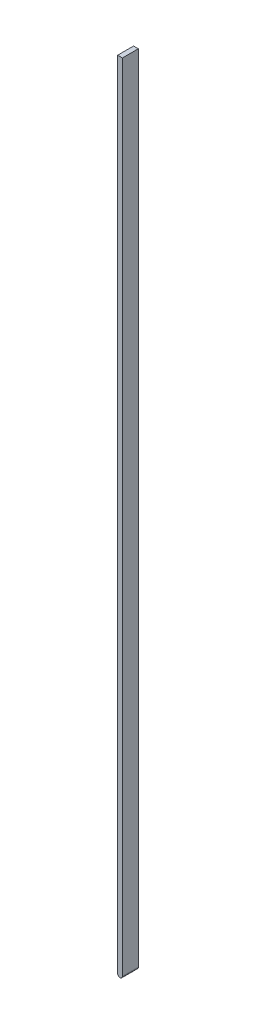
ISO-10303-21;
HEADER;
FILE_DESCRIPTION(('STEP AP214'),'2;1');
FILE_NAME('part.step','',(''),(''),'','','');
FILE_SCHEMA(('AUTOMOTIVE_DESIGN { 1 0 10303 214 1 1 1 1 }'));
ENDSEC;
DATA;
#1=APPLICATION_CONTEXT('core data for automotive mechanical design processes');
#2=APPLICATION_PROTOCOL_DEFINITION('international standard','automotive_design',2000,#1);
#3=PRODUCT_CONTEXT('',#1,'mechanical');
#4=PRODUCT('Part','Part','',(#3));
#5=PRODUCT_RELATED_PRODUCT_CATEGORY('part','',(#4));
#6=PRODUCT_DEFINITION_FORMATION('','',#4);
#7=PRODUCT_DEFINITION_CONTEXT('part definition',#1,'design');
#8=PRODUCT_DEFINITION('design','',#6,#7);
#9=PRODUCT_DEFINITION_SHAPE('','',#8);
#10=(LENGTH_UNIT() NAMED_UNIT(*) SI_UNIT(.MILLI.,.METRE.));
#11=(NAMED_UNIT(*) PLANE_ANGLE_UNIT() SI_UNIT($,.RADIAN.));
#12=(NAMED_UNIT(*) SI_UNIT($,.STERADIAN.) SOLID_ANGLE_UNIT());
#13=UNCERTAINTY_MEASURE_WITH_UNIT(LENGTH_MEASURE(1.E-05),#10,'distance_accuracy_value','');
#14=(GEOMETRIC_REPRESENTATION_CONTEXT(3) GLOBAL_UNCERTAINTY_ASSIGNED_CONTEXT((#13)) GLOBAL_UNIT_ASSIGNED_CONTEXT((#10,
#11,#12)) REPRESENTATION_CONTEXT('',''));
#15=CARTESIAN_POINT('',(0.,0.,0.));
#16=DIRECTION('',(0.,0.,1.));
#17=DIRECTION('',(1.,0.,0.));
#18=AXIS2_PLACEMENT_3D('',#15,#16,#17);
#19=CARTESIAN_POINT('',(0.,0.,-10.));
#20=DIRECTION('',(0.,0.,1.));
#21=DIRECTION('',(1.,0.,0.));
#22=AXIS2_PLACEMENT_3D('',#19,#20,#21);
#23=CYLINDRICAL_SURFACE('',#22,3.);
#24=DIRECTION('',(0.,0.,1.));
#25=VECTOR('',#24,1.);
#26=CARTESIAN_POINT('',(3.,0.,-10.));
#27=LINE('',#26,#25);
#28=CARTESIAN_POINT('',(3.,0.,-10.));
#29=VERTEX_POINT('',#28);
#30=CARTESIAN_POINT('',(3.,0.,10.));
#31=VERTEX_POINT('',#30);
#32=EDGE_CURVE('E33',#29,#31,#27,.T.);
#33=ORIENTED_EDGE('',*,*,#32,.T.);
#34=CARTESIAN_POINT('',(0.,0.,10.));
#35=DIRECTION('',(0.,0.,1.));
#36=DIRECTION('',(1.,0.,0.));
#37=AXIS2_PLACEMENT_3D('',#34,#35,#36);
#38=CIRCLE('',#37,3.);
#39=CARTESIAN_POINT('',(-3.,0.,10.));
#40=VERTEX_POINT('',#39);
#41=EDGE_CURVE('E70',#40,#31,#38,.T.);
#42=ORIENTED_EDGE('',*,*,#41,.F.);
#43=DIRECTION('',(0.,0.,1.));
#44=VECTOR('',#43,1.);
#45=CARTESIAN_POINT('',(-3.,0.,-10.));
#46=LINE('',#45,#44);
#47=CARTESIAN_POINT('',(-3.,0.,-10.));
#48=VERTEX_POINT('',#47);
#49=EDGE_CURVE('E11',#48,#40,#46,.T.);
#50=ORIENTED_EDGE('',*,*,#49,.F.);
#51=CARTESIAN_POINT('',(0.,0.,-10.));
#52=DIRECTION('',(0.,0.,1.));
#53=DIRECTION('',(1.,0.,0.));
#54=AXIS2_PLACEMENT_3D('',#51,#52,#53);
#55=CIRCLE('',#54,3.);
#56=EDGE_CURVE('E71',#48,#29,#55,.T.);
#57=ORIENTED_EDGE('',*,*,#56,.T.);
#58=EDGE_LOOP('',(#33,#42,#50,#57));
#59=FACE_BOUND('',#58,.T.);
#60=ADVANCED_FACE('F30',(#59),#23,.T.);
#61=CARTESIAN_POINT('',(-3.,0.,-10.));
#62=DIRECTION('',(-1.,0.,0.));
#63=DIRECTION('',(0.,0.,1.));
#64=AXIS2_PLACEMENT_3D('',#61,#62,#63);
#65=PLANE('',#64);
#66=ORIENTED_EDGE('',*,*,#49,.T.);
#67=DIRECTION('',(0.,-1.,0.));
#68=VECTOR('',#67,1.);
#69=CARTESIAN_POINT('',(-3.,0.,10.));
#70=LINE('',#69,#68);
#71=CARTESIAN_POINT('',(-3.,1000.,10.));
#72=VERTEX_POINT('',#71);
#73=EDGE_CURVE('E87',#72,#40,#70,.T.);
#74=ORIENTED_EDGE('',*,*,#73,.F.);
#75=DIRECTION('',(0.,0.,1.));
#76=VECTOR('',#75,1.);
#77=CARTESIAN_POINT('',(-3.,1000.,-10.));
#78=LINE('',#77,#76);
#79=CARTESIAN_POINT('',(-3.,1000.,-10.));
#80=VERTEX_POINT('',#79);
#81=EDGE_CURVE('E38',#80,#72,#78,.T.);
#82=ORIENTED_EDGE('',*,*,#81,.F.);
#83=DIRECTION('',(0.,-1.,0.));
#84=VECTOR('',#83,1.);
#85=CARTESIAN_POINT('',(-3.,0.,-10.));
#86=LINE('',#85,#84);
#87=EDGE_CURVE('E76',#80,#48,#86,.T.);
#88=ORIENTED_EDGE('',*,*,#87,.T.);
#89=EDGE_LOOP('',(#66,#74,#82,#88));
#90=FACE_BOUND('',#89,.T.);
#91=ADVANCED_FACE('F102',(#90),#65,.T.);
#92=CARTESIAN_POINT('',(-3.,1000.,-10.));
#93=DIRECTION('',(0.,1.,0.));
#94=DIRECTION('',(0.,0.,1.));
#95=AXIS2_PLACEMENT_3D('',#92,#93,#94);
#96=PLANE('',#95);
#97=ORIENTED_EDGE('',*,*,#81,.T.);
#98=DIRECTION('',(-1.,0.,0.));
#99=VECTOR('',#98,1.);
#100=CARTESIAN_POINT('',(-3.,1000.,10.));
#101=LINE('',#100,#99);
#102=CARTESIAN_POINT('',(3.,1000.,10.));
#103=VERTEX_POINT('',#102);
#104=EDGE_CURVE('E83',#103,#72,#101,.T.);
#105=ORIENTED_EDGE('',*,*,#104,.F.);
#106=DIRECTION('',(0.,0.,1.));
#107=VECTOR('',#106,1.);
#108=CARTESIAN_POINT('',(3.,1000.,-10.));
#109=LINE('',#108,#107);
#110=CARTESIAN_POINT('',(3.,1000.,-10.));
#111=VERTEX_POINT('',#110);
#112=EDGE_CURVE('E75',#111,#103,#109,.T.);
#113=ORIENTED_EDGE('',*,*,#112,.F.);
#114=DIRECTION('',(-1.,0.,0.));
#115=VECTOR('',#114,1.);
#116=CARTESIAN_POINT('',(-3.,1000.,-10.));
#117=LINE('',#116,#115);
#118=EDGE_CURVE('E95',#111,#80,#117,.T.);
#119=ORIENTED_EDGE('',*,*,#118,.T.);
#120=EDGE_LOOP('',(#97,#105,#113,#119));
#121=FACE_BOUND('',#120,.T.);
#122=ADVANCED_FACE('F99',(#121),#96,.T.);
#123=CARTESIAN_POINT('',(3.,0.,-10.));
#124=DIRECTION('',(1.,0.,0.));
#125=DIRECTION('',(0.,0.,-1.));
#126=AXIS2_PLACEMENT_3D('',#123,#124,#125);
#127=PLANE('',#126);
#128=ORIENTED_EDGE('',*,*,#112,.T.);
#129=DIRECTION('',(0.,1.,0.));
#130=VECTOR('',#129,1.);
#131=CARTESIAN_POINT('',(3.,0.,10.));
#132=LINE('',#131,#130);
#133=EDGE_CURVE('E78',#31,#103,#132,.T.);
#134=ORIENTED_EDGE('',*,*,#133,.F.);
#135=ORIENTED_EDGE('',*,*,#32,.F.);
#136=DIRECTION('',(0.,1.,0.));
#137=VECTOR('',#136,1.);
#138=CARTESIAN_POINT('',(3.,0.,-10.));
#139=LINE('',#138,#137);
#140=EDGE_CURVE('E93',#29,#111,#139,.T.);
#141=ORIENTED_EDGE('',*,*,#140,.T.);
#142=EDGE_LOOP('',(#128,#134,#135,#141));
#143=FACE_BOUND('',#142,.T.);
#144=ADVANCED_FACE('F79',(#143),#127,.T.);
#145=CARTESIAN_POINT('',(0.,0.,-10.));
#146=DIRECTION('',(0.,0.,1.));
#147=DIRECTION('',(1.,0.,0.));
#148=AXIS2_PLACEMENT_3D('',#145,#146,#147);
#149=PLANE('',#148);
#150=ORIENTED_EDGE('',*,*,#56,.F.);
#151=ORIENTED_EDGE('',*,*,#87,.F.);
#152=ORIENTED_EDGE('',*,*,#118,.F.);
#153=ORIENTED_EDGE('',*,*,#140,.F.);
#154=EDGE_LOOP('',(#150,#151,#152,#153));
#155=FACE_BOUND('',#154,.T.);
#156=ADVANCED_FACE('F104',(#155),#149,.F.);
#157=CARTESIAN_POINT('',(0.,0.,10.));
#158=DIRECTION('',(0.,0.,1.));
#159=DIRECTION('',(1.,0.,0.));
#160=AXIS2_PLACEMENT_3D('',#157,#158,#159);
#161=PLANE('',#160);
#162=ORIENTED_EDGE('',*,*,#41,.T.);
#163=ORIENTED_EDGE('',*,*,#133,.T.);
#164=ORIENTED_EDGE('',*,*,#104,.T.);
#165=ORIENTED_EDGE('',*,*,#73,.T.);
#166=EDGE_LOOP('',(#162,#163,#164,#165));
#167=FACE_BOUND('',#166,.T.);
#168=ADVANCED_FACE('F86',(#167),#161,.T.);
#169=CLOSED_SHELL('',(#60,#91,#122,#144,#156,#168));
#170=MANIFOLD_SOLID_BREP('B2',#169);
#171=ADVANCED_BREP_SHAPE_REPRESENTATION('',(#18,#170),#14);
#172=SHAPE_DEFINITION_REPRESENTATION(#9,#171);
ENDSEC;
END-ISO-10303-21;
